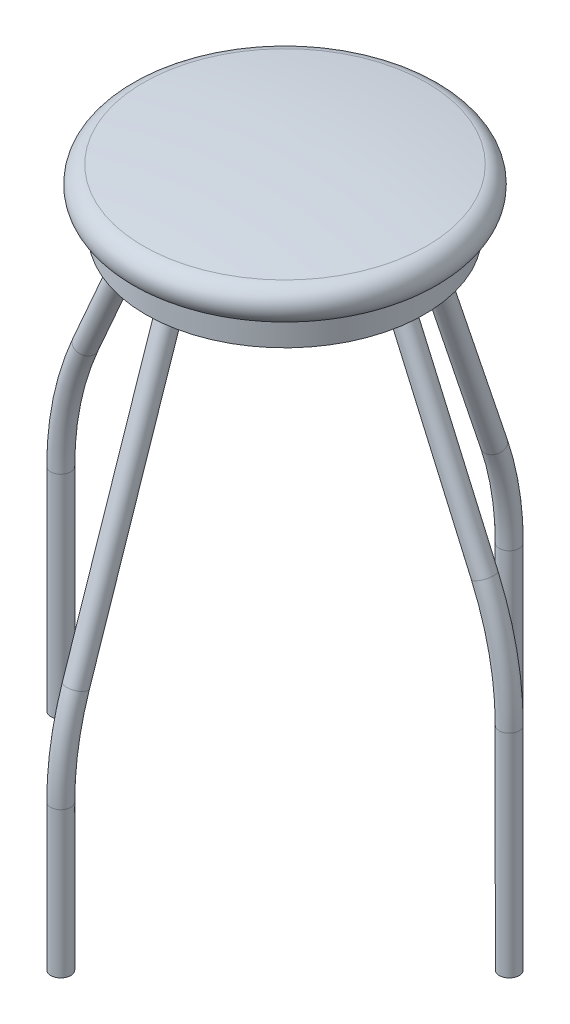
from build123d import *

# Parameters (mm, degrees)
SKETCH3_R          = 162.1424800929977
CUT_EXTRUDE1_DEPTH = 43.18
SKETCH12_R         = 13.056189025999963
SKETCH12_R_2       = 10.51618902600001
SKETCH14_R         = 13.056189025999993
SKETCH14_R_2       = 10.516189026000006


with BuildPart() as part:
    # Sketch2 → Revolve1 (revolve)
    with BuildSketch(Plane.XY, mode=Mode.PRIVATE) as revolve1_sk:
        with BuildLine():
            Line((0, 0), (183.638340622, 0))
            Line((183.638340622, 0), (183.63834062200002, 34.56987931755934))
            ThreePointArc((183.63834062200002, 34.56987931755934), (206.22089048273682, 55.685545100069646), (186.66717797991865, 79.63330547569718))
            ThreePointArc((186.66717797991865, 79.63330547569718), (93.54417125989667, 89.03958352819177), (0, 92.179722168))
            Line((0, 92.179722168), (0, 0))
        make_face()
    revolve(revolve1_sk.sketch.rotate(Axis((0, 0, 0), (0, 1, 0)), 90), axis=Axis((0, 0, 0), (0, 1, 0)))

    # Sketch3 → Cut-Extrude1 (cut)
    with BuildSketch(Plane.XZ):
        with Locations(Location((0, 0, 0), (0, 0, 270))):
            Circle(SKETCH3_R)
    extrude(amount=-CUT_EXTRUDE1_DEPTH, mode=Mode.SUBTRACT)

    # Sweep4: sweep along a path in Sketch11
    with BuildLine(Plane.XY) as sweep4_path:
        Line((-295.5692614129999, -692.0849529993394), (-295.5692614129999, -412.6849529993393))
        ThreePointArc((-295.5692614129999, -412.6849529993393), (-287.3570208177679, -333.4835905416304), (-263.06970909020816, -257.6520456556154))
        Line((-263.06970909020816, -257.6520456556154), (-145.6078248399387, 10.200927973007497))
        ThreePointArc((-145.6078248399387, 10.200927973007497), (-136.2397050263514, 21.263390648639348), (-122.34624565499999, 25.39999988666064))
        Line((-122.34624565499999, 25.39999988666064), (122.34624565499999, 25.399999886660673))
        ThreePointArc((122.34624565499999, 25.399999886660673), (136.2397050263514, 21.263390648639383), (145.6078248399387, 10.200927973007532))
        Line((145.6078248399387, 10.200927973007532), (263.0697090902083, -257.6520456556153))
        ThreePointArc((263.0697090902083, -257.6520456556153), (287.357020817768, -333.4835905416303), (295.569261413, -412.68495299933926))
        Line((295.569261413, -412.68495299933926), (295.5692614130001, -692.0849529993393))
    # Sketch12 → Sweep4 (sweep)
    with BuildSketch(Plane(origin=(0, -692.0849529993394, 0), x_dir=(-1, 0, 0), z_dir=(0, 1, 0))):
        with Locations((295.5692614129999, 0)):
            Circle(SKETCH12_R)
        with Locations((295.5692614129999, 0)):
            Circle(SKETCH12_R_2, mode=Mode.SUBTRACT)
    sweep(path=sweep4_path.line)

    # Sweep5: sweep along a path in Sketch13
    with BuildLine(Plane(origin=(0, 0, 0), x_dir=(0, 0, -1), z_dir=(1, 0, 0))) as sweep5_path:
        Line((-295.5692614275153, -692.0849529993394), (-295.5692614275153, -500.07104081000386))
        ThreePointArc((-295.5692614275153, -500.07104081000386), (-290.53842911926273, -437.95206558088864), (-275.57705908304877, -377.45219976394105))
        Line((-275.57705908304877, -377.45219976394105), (-146.43078938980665, 8.068132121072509))
        ThreePointArc((-146.43078938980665, 8.068132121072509), (-137.18250946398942, 20.616626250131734), (-122.34624571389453, 25.400000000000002))
        Line((-122.34624571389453, 25.400000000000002), (122.34624571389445, 25.400000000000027))
        ThreePointArc((122.34624571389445, 25.400000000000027), (137.18250946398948, 20.616626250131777), (146.43078938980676, 8.068132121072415))
        Line((146.43078938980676, 8.068132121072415), (275.5770590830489, -377.452199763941))
        ThreePointArc((275.5770590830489, -377.452199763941), (290.5384291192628, -437.9520655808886), (295.56926142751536, -500.07104081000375))
        Line((295.56926142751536, -500.07104081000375), (295.56926142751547, -692.0849529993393))
    # Sketch14 → Sweep5 (sweep)
    with BuildSketch(Plane(origin=(0, -692.0849529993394, 0), x_dir=(-1, 0, 0), z_dir=(0, 1, 0))):
        with Locations((0, 295.5692614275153)):
            Circle(SKETCH14_R)
        with Locations((0, 295.5692614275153)):
            Circle(SKETCH14_R_2, mode=Mode.SUBTRACT)
    sweep(path=sweep5_path.line)


solid = part.part
